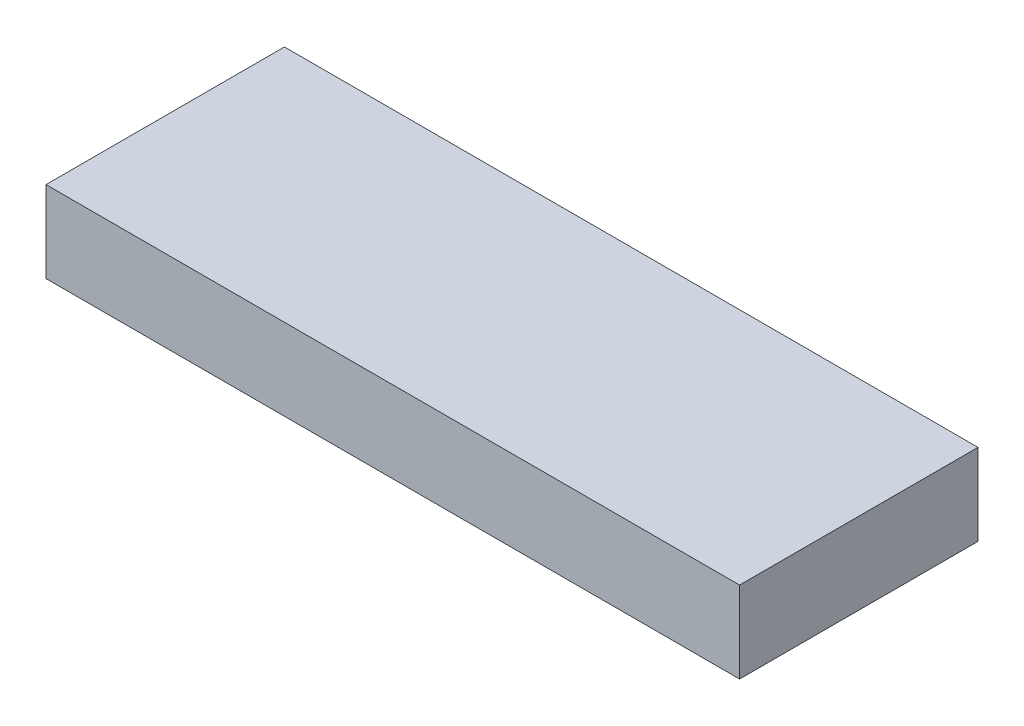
from build123d import *

# Parameters (mm, degrees)
SKETCH1_W           = 1625.6
SKETCH1_H           = 558.8
BOSS_EXTRUDE1_DEPTH = 190.833959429


with BuildPart() as part:
    # Sketch1 → Boss-Extrude1 (new body)
    with BuildSketch(Plane(origin=(0, 0, 0), x_dir=(1, 0, 0), z_dir=(0, 1, 0))):
        Rectangle(SKETCH1_W, SKETCH1_H)
    extrude(amount=BOSS_EXTRUDE1_DEPTH)


solid = part.part
